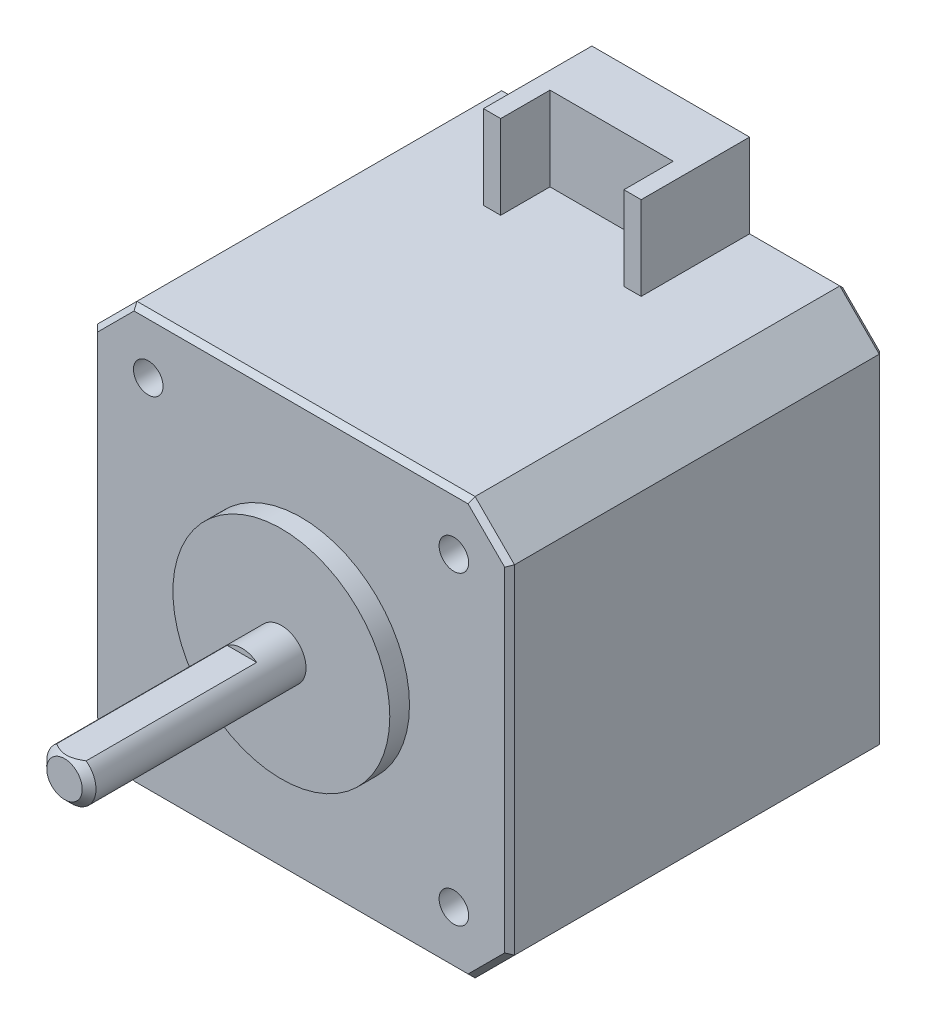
from build123d import *

# Parameters (mm, degrees)
SKETCH1_W           = 42.3
SKETCH1_H           = 42.3
SKETCH1_R           = 1.5
BOSS_EXTRUDE1_DEPTH = 38
SKETCH2_R           = 11
SKETCH2_R_2         = 2.5
BOSS_EXTRUDE2_DEPTH = 2
SKETCH2_3_R         = 2.5
BOSS_EXTRUDE3_DEPTH = 24
SKETCH3_R           = 1.5
CUT_EXTRUDE1_DEPTH  = 5
CHAMFER1_SIZE       = 4
CHAMFER2_SIZE       = 0.7
SKETCH4_R           = 8
SKETCH4_R_2         = 2.5
CUT_EXTRUDE2_DEPTH  = 0.5
CHAMFER3_SIZE       = 0.3
CHAMFER4_SIZE       = 0.5
SKETCH5_R           = 3
CUT_EXTRUDE3_DEPTH  = 0.5
CUT_EXTRUDE4_DEPTH  = 2
CHAMFER5_SIZE       = 0.3
CUT_EXTRUDE5_START  = -18
CUT_EXTRUDE5_DEPTH  = 18
BOSS_EXTRUDE5_DEPTH = 8.5


with BuildPart() as part:
    # Sketch1 → Boss-Extrude1 (new body)
    # profile 1 of 5: a face of its own
    with BuildSketch(Plane.XY):
        Rectangle(SKETCH1_W, SKETCH1_H)
        with Locations((-15.5, -15.5)):
            Circle(SKETCH1_R, mode=Mode.SUBTRACT)
        with Locations((15.5, -15.5)):
            Circle(SKETCH1_R, mode=Mode.SUBTRACT)
        with Locations((15.5, 15.5)):
            Circle(SKETCH1_R, mode=Mode.SUBTRACT)
        with Locations((-15.5, 15.5)):
            Circle(SKETCH1_R, mode=Mode.SUBTRACT)
    # profile 2 of 5: a face of its own
    with BuildSketch(Plane.XY):
        with Locations((-15.5, -15.5)):
            Circle(SKETCH1_R)
    # profile 3 of 5: a face of its own
    with BuildSketch(Plane.XY):
        with Locations((15.5, -15.5)):
            Circle(SKETCH1_R)
    # profile 4 of 5: a face of its own
    with BuildSketch(Plane.XY):
        with Locations((15.5, 15.5)):
            Circle(SKETCH1_R)
    # profile 5 of 5: a face of its own
    with BuildSketch(Plane.XY):
        with Locations((-15.5, 15.5)):
            Circle(SKETCH1_R)
    extrude(amount=BOSS_EXTRUDE1_DEPTH)

    # Sketch2 → Boss-Extrude2 (add)
    with BuildSketch(Plane.XY.offset(38)):
        Circle(SKETCH2_R)
        Circle(SKETCH2_R_2, mode=Mode.SUBTRACT)
    extrude(amount=BOSS_EXTRUDE2_DEPTH)

    # Sketch2_3 → Boss-Extrude3 (add)
    with BuildSketch(Plane.XY.offset(38)):
        Circle(SKETCH2_3_R)
    extrude(amount=BOSS_EXTRUDE3_DEPTH)

    # Sketch3 → Cut-Extrude1 (cut)
    with BuildSketch(Plane.XY.offset(38)):
        with Locations((-15.5, -15.5)):
            Circle(SKETCH3_R)
        with Locations((15.5, -15.5)):
            Circle(SKETCH3_R)
        with Locations((15.5, 15.5)):
            Circle(SKETCH3_R)
        with Locations((-15.5, 15.5)):
            Circle(SKETCH3_R)
    extrude(amount=-CUT_EXTRUDE1_DEPTH, mode=Mode.SUBTRACT)

    # Chamfer1
    chamfer1_edges = [part.edges().sort_by_distance(p)[0] for p in [
        (-21.15, -21.15, 19),
        (-21.15, 21.15, 19),
        (21.15, 21.15, 19),
        (21.15, -21.15, 19),
    ]]
    chamfer(chamfer1_edges, length=CHAMFER1_SIZE)

    # Chamfer2
    chamfer2_edges = [part.edges().sort_by_distance(p)[0] for p in [
        (-2.5, 0, 62),
    ]]
    chamfer(chamfer2_edges, length=CHAMFER2_SIZE)

    # Sketch4 → Cut-Extrude2 (cut)
    with BuildSketch(Plane(origin=(0, 0, 0), x_dir=(-1, 0, 0), z_dir=(0, 0, -1))):
        Circle(SKETCH4_R)
        Circle(SKETCH4_R_2, mode=Mode.SUBTRACT)
    extrude(amount=-CUT_EXTRUDE2_DEPTH, mode=Mode.SUBTRACT)

    # Chamfer3
    chamfer3_edges = [part.edges().sort_by_distance(p)[0] for p in [
        (2.5, 0, 0),
    ]]
    chamfer(chamfer3_edges, length=CHAMFER3_SIZE)

    # Chamfer4
    chamfer4_edges = [part.edges().sort_by_distance(p)[0] for p in [
        (-21.15, 0, 0),
        (-21.15, 0, 38),
        (0, -21.15, 0),
        (0, 21.15, 0),
        (21.15, 0, 0),
        (-19.15, -19.15, 0),
        (19.15, -19.15, 0),
        (19.15, 19.15, 0),
        (-19.15, 19.15, 0),
        (0, 21.15, 38),
        (0, -21.15, 38),
        (21.15, 0, 38),
        (-19.15, -19.15, 38),
        (19.15, -19.15, 38),
        (19.15, 19.15, 38),
        (-19.15, 19.15, 38),
    ]]
    chamfer(chamfer4_edges, length=CHAMFER4_SIZE)

    # Sketch5 → Cut-Extrude3 (cut)
    # profile 1 of 4: a face of its own
    with BuildSketch(Plane(origin=(0, 0, 0), x_dir=(-1, 0, 0), z_dir=(0, 0, -1))):
        with Locations((-15.5, 15.5)):
            Circle(SKETCH5_R)
        Polygon((-14, 14.633974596), (-14, 16.366025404), (-15.5, 17.232050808), (-17, 16.366025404), (-17, 14.633974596), (-15.5, 13.767949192), align=None, mode=Mode.SUBTRACT)
    # profile 2 of 4: a face of its own
    with BuildSketch(Plane(origin=(0, 0, 0), x_dir=(-1, 0, 0), z_dir=(0, 0, -1))):
        with Locations((15.5, 15.5)):
            Circle(SKETCH5_R)
        Polygon((17, 14.633974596), (17, 16.366025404), (15.5, 17.232050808), (14, 16.366025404), (14, 14.633974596), (15.5, 13.767949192), align=None, mode=Mode.SUBTRACT)
    # profile 3 of 4: a face of its own
    with BuildSketch(Plane(origin=(0, 0, 0), x_dir=(-1, 0, 0), z_dir=(0, 0, -1))):
        with Locations((15.5, -15.5)):
            Circle(SKETCH5_R)
        Polygon((15.5, -17.232050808), (17, -16.366025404), (17, -14.633974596), (15.5, -13.767949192), (14, -14.633974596), (14, -16.366025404), align=None, mode=Mode.SUBTRACT)
    # profile 4 of 4: a face of its own
    with BuildSketch(Plane(origin=(0, 0, 0), x_dir=(-1, 0, 0), z_dir=(0, 0, -1))):
        with Locations((-15.5, -15.5)):
            Circle(SKETCH5_R)
        Polygon((-14, -16.366025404), (-14, -14.633974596), (-15.5, -13.767949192), (-17, -14.633974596), (-17, -16.366025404), (-15.5, -17.232050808), align=None, mode=Mode.SUBTRACT)
    extrude(amount=-CUT_EXTRUDE3_DEPTH, mode=Mode.SUBTRACT)

    # Sketch5_3 → Cut-Extrude4 (cut)
    with BuildSketch(Plane(origin=(0, 0, 0), x_dir=(-1, 0, 0), z_dir=(0, 0, -1))):
        Polygon((-15.5, 13.767949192), (-14, 14.633974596), (-14, 16.366025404), (-15.5, 17.232050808), (-17, 16.366025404), (-17, 14.633974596), align=None)
        Polygon((15.5, 13.767949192), (17, 14.633974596), (17, 16.366025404), (15.5, 17.232050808), (14, 16.366025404), (14, 14.633974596), align=None)
        Polygon((14, -16.366025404), (15.5, -17.232050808), (17, -16.366025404), (17, -14.633974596), (15.5, -13.767949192), (14, -14.633974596), align=None)
        Polygon((-15.5, -17.232050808), (-14, -16.366025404), (-14, -14.633974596), (-15.5, -13.767949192), (-17, -14.633974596), (-17, -16.366025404), align=None)
    extrude(amount=-CUT_EXTRUDE4_DEPTH, mode=Mode.SUBTRACT)

    # Chamfer5
    chamfer5_edges = [part.edges().sort_by_distance(p)[0] for p in [
        (18.5, -15.5, 0),
        (-12.5, -15.5, 0),
        (-12.5, 15.5, 0),
        (18.5, 15.5, 0),
    ]]
    chamfer(chamfer5_edges, length=CHAMFER5_SIZE)

    # Sketch6 → Cut-Extrude5 (cut)
    with BuildSketch(Plane.XY.offset(62).offset(CUT_EXTRUDE5_START)):
        with BuildLine():
            ThreePointArc((1.5, 2), (0, 2.5), (-1.5, 2))
            Line((-1.5, 2), (1.5, 2))
        make_face()
    extrude(amount=CUT_EXTRUDE5_DEPTH, mode=Mode.SUBTRACT)

    # Sketch7 → Boss-Extrude5 (add)
    with BuildSketch(Plane(origin=(0, 21.15, 0), x_dir=(1, 0, 0), z_dir=(0, 1, 0))):
        Polygon((8, -0.5), (-8, -0.5), (-8, -11.5), (-6.25, -11.5), (-6.25, -6.5), (6.25, -6.5), (6.25, -11.5), (8, -11.5), align=None)
    extrude(amount=BOSS_EXTRUDE5_DEPTH)


solid = part.part
